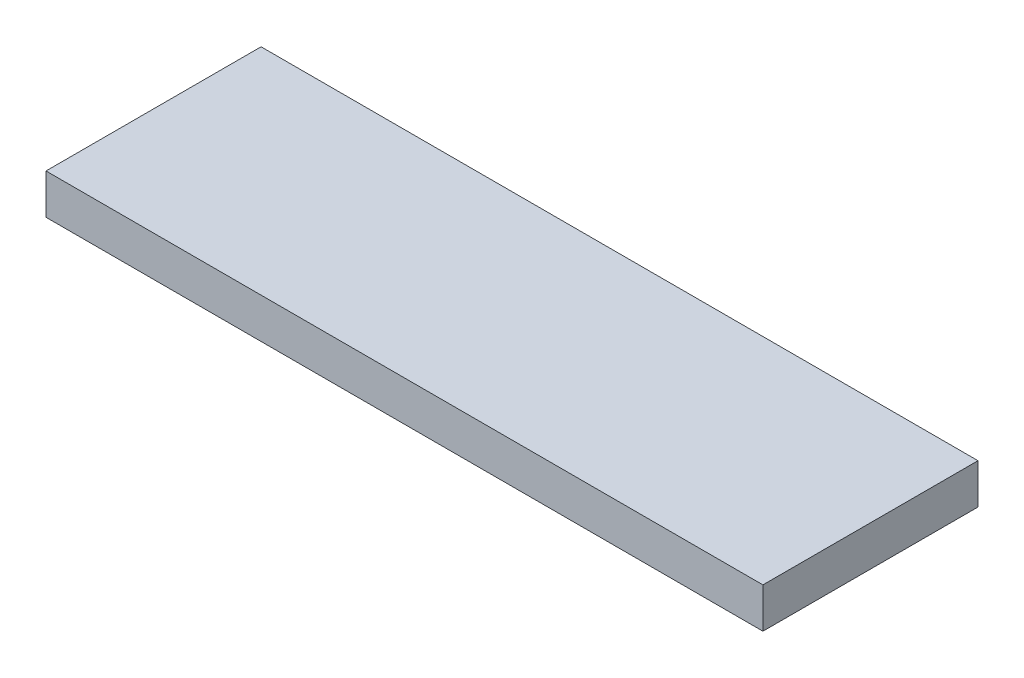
from build123d import *

# Parameters (mm, degrees)
SKETCH2_W           = 50
SKETCH2_H           = 15
BOSS_EXTRUDE1_DEPTH = 2.8


with BuildPart() as part:
    # Sketch2 → Boss-Extrude1 (new body)
    with BuildSketch(Plane(origin=(0, 0, 0), x_dir=(1, 0, 0), z_dir=(0, 1, 0))):
        with Locations((25, 7.5)):
            Rectangle(SKETCH2_W, SKETCH2_H)
    extrude(amount=BOSS_EXTRUDE1_DEPTH)


solid = part.part
